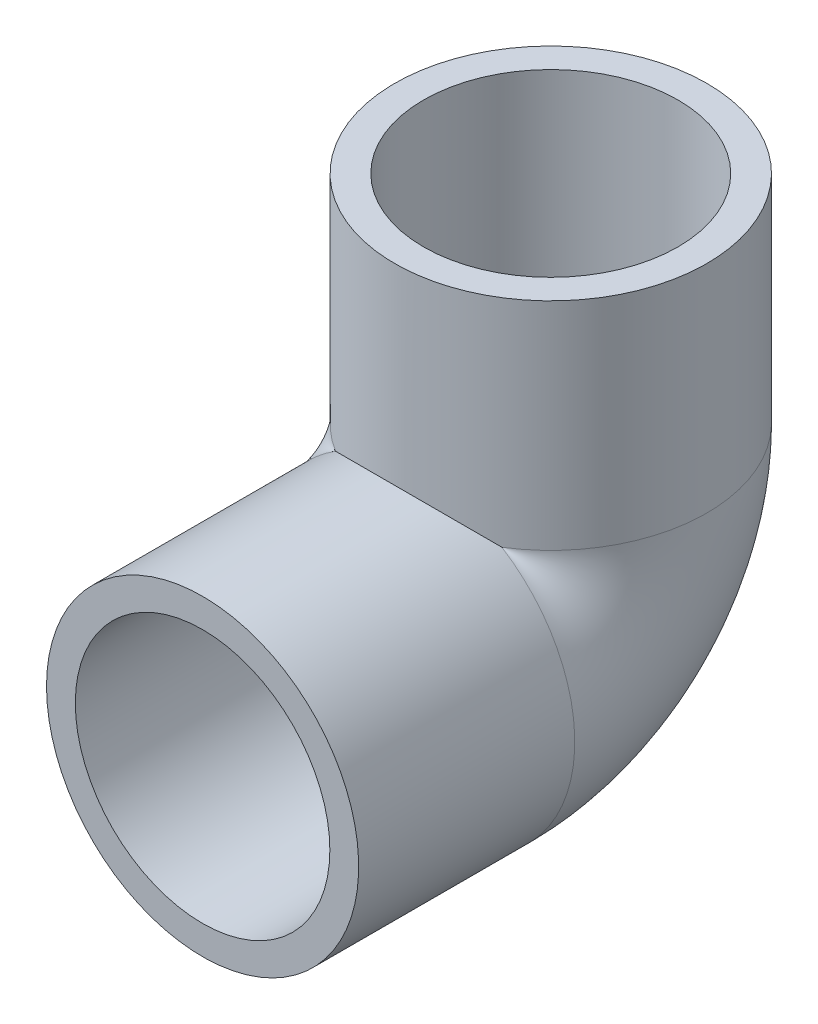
ISO-10303-21;
HEADER;
FILE_DESCRIPTION(('STEP AP214'),'2;1');
FILE_NAME('part.step','',(''),(''),'','','');
FILE_SCHEMA(('AUTOMOTIVE_DESIGN { 1 0 10303 214 1 1 1 1 }'));
ENDSEC;
DATA;
#1=APPLICATION_CONTEXT('core data for automotive mechanical design processes');
#2=APPLICATION_PROTOCOL_DEFINITION('international standard','automotive_design',2000,#1);
#3=PRODUCT_CONTEXT('',#1,'mechanical');
#4=PRODUCT('Part','Part','',(#3));
#5=PRODUCT_RELATED_PRODUCT_CATEGORY('part','',(#4));
#6=PRODUCT_DEFINITION_FORMATION('','',#4);
#7=PRODUCT_DEFINITION_CONTEXT('part definition',#1,'design');
#8=PRODUCT_DEFINITION('design','',#6,#7);
#9=PRODUCT_DEFINITION_SHAPE('','',#8);
#10=(LENGTH_UNIT() NAMED_UNIT(*) SI_UNIT(.MILLI.,.METRE.));
#11=(NAMED_UNIT(*) PLANE_ANGLE_UNIT() SI_UNIT($,.RADIAN.));
#12=(NAMED_UNIT(*) SI_UNIT($,.STERADIAN.) SOLID_ANGLE_UNIT());
#13=UNCERTAINTY_MEASURE_WITH_UNIT(LENGTH_MEASURE(1.E-05),#10,'distance_accuracy_value','');
#14=(GEOMETRIC_REPRESENTATION_CONTEXT(3) GLOBAL_UNCERTAINTY_ASSIGNED_CONTEXT((#13)) GLOBAL_UNIT_ASSIGNED_CONTEXT((#10,
#11,#12)) REPRESENTATION_CONTEXT('',''));
#15=CARTESIAN_POINT('',(0.,0.,0.));
#16=DIRECTION('',(0.,0.,1.));
#17=DIRECTION('',(1.,0.,0.));
#18=AXIS2_PLACEMENT_3D('',#15,#16,#17);
#19=CARTESIAN_POINT('',(0.,16.8275,46.0375));
#20=DIRECTION('',(0.,0.,1.));
#21=DIRECTION('',(1.,0.,0.));
#22=AXIS2_PLACEMENT_3D('',#19,#20,#21);
#23=PLANE('',#22);
#24=CARTESIAN_POINT('',(0.,0.,46.0375));
#25=DIRECTION('',(0.,0.,-1.));
#26=DIRECTION('',(-1.,0.,0.));
#27=AXIS2_PLACEMENT_3D('',#24,#25,#26);
#28=CIRCLE('',#27,16.8275);
#29=CARTESIAN_POINT('',(-16.8275,0.,46.0375));
#30=VERTEX_POINT('',#29);
#31=EDGE_CURVE('E84',#30,#30,#28,.T.);
#32=ORIENTED_EDGE('',*,*,#31,.T.);
#33=EDGE_LOOP('',(#32));
#34=FACE_BOUND('',#33,.T.);
#35=CARTESIAN_POINT('',(0.,0.,46.0375));
#36=DIRECTION('',(0.,0.,-1.));
#37=DIRECTION('',(-1.,0.,0.));
#38=AXIS2_PLACEMENT_3D('',#35,#36,#37);
#39=CIRCLE('',#38,20.6375);
#40=CARTESIAN_POINT('',(-20.6375,0.,46.0375));
#41=VERTEX_POINT('',#40);
#42=EDGE_CURVE('E11',#41,#41,#39,.T.);
#43=ORIENTED_EDGE('',*,*,#42,.F.);
#44=EDGE_LOOP('',(#43));
#45=FACE_BOUND('',#44,.T.);
#46=ADVANCED_FACE('F34',(#34,#45),#23,.T.);
#47=CARTESIAN_POINT('',(0.,0.,0.));
#48=DIRECTION('',(0.,0.,-1.));
#49=DIRECTION('',(-1.,0.,0.));
#50=AXIS2_PLACEMENT_3D('',#47,#48,#49);
#51=CYLINDRICAL_SURFACE('',#50,20.6375);
#52=CARTESIAN_POINT('',(0.,0.,0.));
#53=DIRECTION('',(0.,0.707106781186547,-0.707106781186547));
#54=DIRECTION('',(0.,-0.707106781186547,-0.707106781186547));
#55=AXIS2_PLACEMENT_3D('',#52,#53,#54);
#56=ELLIPSE('',#55,29.1858323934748,20.6375);
#57=CARTESIAN_POINT('',(-10.9985226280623,17.4625,17.4625));
#58=VERTEX_POINT('',#57);
#59=CARTESIAN_POINT('',(10.9985226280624,17.4625,17.4625));
#60=VERTEX_POINT('',#59);
#61=EDGE_CURVE('E86',#58,#60,#56,.T.);
#62=ORIENTED_EDGE('',*,*,#61,.F.);
#63=CARTESIAN_POINT('',(0.,0.,17.4625));
#64=DIRECTION('',(0.,0.,-1.));
#65=DIRECTION('',(-1.,0.,0.));
#66=AXIS2_PLACEMENT_3D('',#63,#64,#65);
#67=CIRCLE('',#66,20.6375);
#68=EDGE_CURVE('E37',#60,#58,#67,.T.);
#69=ORIENTED_EDGE('',*,*,#68,.F.);
#70=EDGE_LOOP('',(#62,#69));
#71=FACE_BOUND('',#70,.T.);
#72=ORIENTED_EDGE('',*,*,#42,.T.);
#73=EDGE_LOOP('',(#72));
#74=FACE_BOUND('',#73,.T.);
#75=ADVANCED_FACE('F105',(#71,#74),#51,.T.);
#76=CARTESIAN_POINT('',(0.,0.,0.));
#77=DIRECTION('',(0.,0.,-1.));
#78=DIRECTION('',(-1.,0.,0.));
#79=AXIS2_PLACEMENT_3D('',#76,#77,#78);
#80=CYLINDRICAL_SURFACE('',#79,16.8275);
#81=CARTESIAN_POINT('',(0.,0.,17.4625));
#82=DIRECTION('',(0.,0.,-1.));
#83=DIRECTION('',(-1.,0.,0.));
#84=AXIS2_PLACEMENT_3D('',#81,#82,#83);
#85=CIRCLE('',#84,16.8275);
#86=CARTESIAN_POINT('',(-16.8275,0.,17.4625));
#87=VERTEX_POINT('',#86);
#88=EDGE_CURVE('E64',#87,#87,#85,.T.);
#89=ORIENTED_EDGE('',*,*,#88,.T.);
#90=EDGE_LOOP('',(#89));
#91=FACE_BOUND('',#90,.T.);
#92=ORIENTED_EDGE('',*,*,#31,.F.);
#93=EDGE_LOOP('',(#92));
#94=FACE_BOUND('',#93,.T.);
#95=ADVANCED_FACE('F96',(#91,#94),#80,.F.);
#96=CARTESIAN_POINT('',(0.,46.0375,-16.8275));
#97=DIRECTION('',(0.,1.,0.));
#98=DIRECTION('',(0.,0.,1.));
#99=AXIS2_PLACEMENT_3D('',#96,#97,#98);
#100=PLANE('',#99);
#101=CARTESIAN_POINT('',(0.,46.0375,0.));
#102=DIRECTION('',(0.,-1.,0.));
#103=DIRECTION('',(0.,0.,-1.));
#104=AXIS2_PLACEMENT_3D('',#101,#102,#103);
#105=CIRCLE('',#104,16.8275);
#106=CARTESIAN_POINT('',(0.,46.0375,-16.8275));
#107=VERTEX_POINT('',#106);
#108=EDGE_CURVE('E73',#107,#107,#105,.T.);
#109=ORIENTED_EDGE('',*,*,#108,.T.);
#110=EDGE_LOOP('',(#109));
#111=FACE_BOUND('',#110,.T.);
#112=CARTESIAN_POINT('',(0.,46.0375,0.));
#113=DIRECTION('',(0.,-1.,0.));
#114=DIRECTION('',(0.,0.,-1.));
#115=AXIS2_PLACEMENT_3D('',#112,#113,#114);
#116=CIRCLE('',#115,20.6375);
#117=CARTESIAN_POINT('',(0.,46.0375,-20.6375));
#118=VERTEX_POINT('',#117);
#119=EDGE_CURVE('E80',#118,#118,#116,.T.);
#120=ORIENTED_EDGE('',*,*,#119,.F.);
#121=EDGE_LOOP('',(#120));
#122=FACE_BOUND('',#121,.T.);
#123=ADVANCED_FACE('F94',(#111,#122),#100,.T.);
#124=CARTESIAN_POINT('',(0.,0.,0.));
#125=DIRECTION('',(0.,-1.,0.));
#126=DIRECTION('',(0.,0.,-1.));
#127=AXIS2_PLACEMENT_3D('',#124,#125,#126);
#128=CYLINDRICAL_SURFACE('',#127,20.6375);
#129=ORIENTED_EDGE('',*,*,#119,.T.);
#130=EDGE_LOOP('',(#129));
#131=FACE_BOUND('',#130,.T.);
#132=CARTESIAN_POINT('',(0.,17.4625,0.));
#133=DIRECTION('',(0.,-1.,0.));
#134=DIRECTION('',(0.,0.,-1.));
#135=AXIS2_PLACEMENT_3D('',#132,#133,#134);
#136=CIRCLE('',#135,20.6375);
#137=EDGE_CURVE('E49',#58,#60,#136,.T.);
#138=ORIENTED_EDGE('',*,*,#137,.F.);
#139=ORIENTED_EDGE('',*,*,#61,.T.);
#140=EDGE_LOOP('',(#138,#139));
#141=FACE_BOUND('',#140,.T.);
#142=ADVANCED_FACE('F92',(#131,#141),#128,.T.);
#143=CARTESIAN_POINT('',(0.,0.,0.));
#144=DIRECTION('',(0.,-1.,0.));
#145=DIRECTION('',(0.,0.,-1.));
#146=AXIS2_PLACEMENT_3D('',#143,#144,#145);
#147=CYLINDRICAL_SURFACE('',#146,16.8275);
#148=CARTESIAN_POINT('',(0.,17.4625,0.));
#149=DIRECTION('',(0.,-1.,0.));
#150=DIRECTION('',(0.,0.,-1.));
#151=AXIS2_PLACEMENT_3D('',#148,#149,#150);
#152=CIRCLE('',#151,16.8275);
#153=CARTESIAN_POINT('',(0.,17.4625,-16.8275));
#154=VERTEX_POINT('',#153);
#155=EDGE_CURVE('E68',#154,#154,#152,.T.);
#156=ORIENTED_EDGE('',*,*,#155,.T.);
#157=EDGE_LOOP('',(#156));
#158=FACE_BOUND('',#157,.T.);
#159=ORIENTED_EDGE('',*,*,#108,.F.);
#160=EDGE_LOOP('',(#159));
#161=FACE_BOUND('',#160,.T.);
#162=ADVANCED_FACE('F103',(#158,#161),#147,.F.);
#163=CARTESIAN_POINT('',(0.,17.4625000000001,17.4625000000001));
#164=DIRECTION('',(1.,0.,0.));
#165=DIRECTION('',(0.,0.,-1.));
#166=AXIS2_PLACEMENT_3D('',#163,#164,#165);
#167=TOROIDAL_SURFACE('',#166,17.4625000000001,13.1191);
#168=CARTESIAN_POINT('',(0.,17.4625000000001,0.));
#169=DIRECTION('',(0.,1.,0.));
#170=DIRECTION('',(0.,0.,1.));
#171=AXIS2_PLACEMENT_3D('',#168,#169,#170);
#172=CIRCLE('',#171,13.1191);
#173=CARTESIAN_POINT('',(0.,17.4625000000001,13.1191));
#174=VERTEX_POINT('',#173);
#175=EDGE_CURVE('E60',#174,#174,#172,.F.);
#176=ORIENTED_EDGE('',*,*,#175,.F.);
#177=EDGE_LOOP('',(#176));
#178=FACE_BOUND('',#177,.T.);
#179=CARTESIAN_POINT('',(0.,0.,17.4625));
#180=DIRECTION('',(0.,0.,-1.));
#181=DIRECTION('',(0.,1.,0.));
#182=AXIS2_PLACEMENT_3D('',#179,#180,#181);
#183=CIRCLE('',#182,13.1191);
#184=CARTESIAN_POINT('',(0.,13.1191,17.4625));
#185=VERTEX_POINT('',#184);
#186=EDGE_CURVE('E65',#185,#185,#183,.F.);
#187=ORIENTED_EDGE('',*,*,#186,.T.);
#188=EDGE_LOOP('',(#187));
#189=FACE_BOUND('',#188,.T.);
#190=ADVANCED_FACE('F141',(#178,#189),#167,.F.);
#191=CARTESIAN_POINT('',(0.,0.,17.4625));
#192=DIRECTION('',(0.,0.,-1.));
#193=DIRECTION('',(0.,1.,0.));
#194=AXIS2_PLACEMENT_3D('',#191,#192,#193);
#195=PLANE('',#194);
#196=ORIENTED_EDGE('',*,*,#88,.F.);
#197=EDGE_LOOP('',(#196));
#198=FACE_BOUND('',#197,.T.);
#199=ORIENTED_EDGE('',*,*,#186,.F.);
#200=EDGE_LOOP('',(#199));
#201=FACE_BOUND('',#200,.T.);
#202=ADVANCED_FACE('F153',(#198,#201),#195,.F.);
#203=CARTESIAN_POINT('',(0.,17.4625000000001,0.));
#204=DIRECTION('',(0.,1.,0.));
#205=DIRECTION('',(0.,0.,1.));
#206=AXIS2_PLACEMENT_3D('',#203,#204,#205);
#207=PLANE('',#206);
#208=ORIENTED_EDGE('',*,*,#175,.T.);
#209=EDGE_LOOP('',(#208));
#210=FACE_BOUND('',#209,.T.);
#211=ORIENTED_EDGE('',*,*,#155,.F.);
#212=EDGE_LOOP('',(#211));
#213=FACE_BOUND('',#212,.T.);
#214=ADVANCED_FACE('F61',(#210,#213),#207,.T.);
#215=CARTESIAN_POINT('',(0.,17.4625000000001,0.));
#216=DIRECTION('',(0.,-1.,0.));
#217=DIRECTION('',(0.,0.,-1.));
#218=AXIS2_PLACEMENT_3D('',#215,#216,#217);
#219=CIRCLE('',#218,20.6375);
#220=TRIMMED_CURVE('',#219,(PARAMETER_VALUE(-2.57952285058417)),
(PARAMETER_VALUE(2.57952285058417)),.T.,.PARAMETER.);
#221=CARTESIAN_POINT('',(0.,17.4625000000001,17.4625000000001));
#222=DIRECTION('',(1.,0.,0.));
#223=AXIS1_PLACEMENT('',#221,#222);
#224=SURFACE_OF_REVOLUTION('',#220,#223);
#225=ORIENTED_EDGE('',*,*,#68,.T.);
#226=ORIENTED_EDGE('',*,*,#137,.T.);
#227=EDGE_LOOP('',(#225,#226));
#228=FACE_BOUND('',#227,.T.);
#229=ADVANCED_FACE('F166',(#228),#224,.T.);
#230=CLOSED_SHELL('',(#46,#75,#95,#123,#142,#162,#190,#202,#214,#229));
#231=MANIFOLD_SOLID_BREP('B2',#230);
#232=ADVANCED_BREP_SHAPE_REPRESENTATION('',(#18,#231),#14);
#233=SHAPE_DEFINITION_REPRESENTATION(#9,#232);
ENDSEC;
END-ISO-10303-21;
